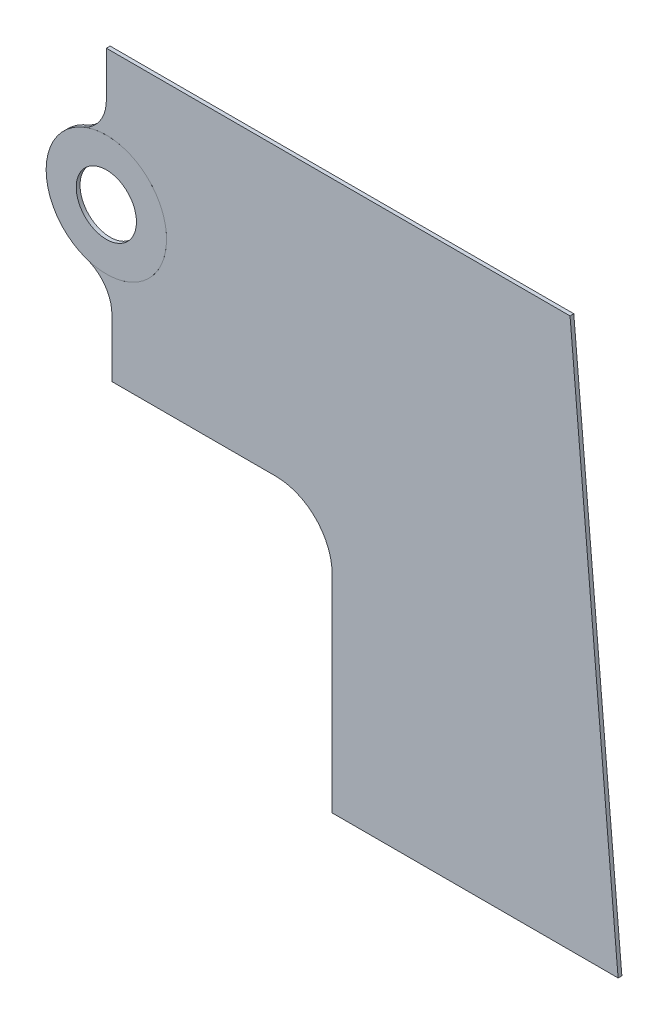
from build123d import *

# Parameters (mm, degrees)
SKETCH1_R              = 8
BOSS_EXTRUDE1_DEPTH    = 1
SPLIT1_SURFACE_1_BACK  = 211.76
SPLIT1_SURFACE_1_DEPTH = 423.52
SPLIT1_SURFACE_2_BACK  = 211.76
SPLIT1_SURFACE_2_DEPTH = 423.52


with BuildPart() as part:
    # Sketch1 → Boss-Extrude1 (new body)
    with BuildSketch(Plane.XY):
        with BuildLine():
            Line((0, 0), (0, 55))
            ThreePointArc((0, 55), (-4.393398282, 65.606601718), (-15, 70))
            Line((-15, 70), (-58.522648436, 70))
            Line((-58.522648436, 70), (-58.522648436, 85.43161905))
            ThreePointArc((-58.522648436, 85.43161905), (-60.374660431, 91.229057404), (-65.24470673, 94.879110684))
            ThreePointArc((-65.24470673, 94.879110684), (-75.992601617, 109.508585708), (-66.153846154, 124.764328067))
            ThreePointArc((-66.153846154, 124.764328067), (-61.679497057, 128.448095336), (-60, 133.995097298))
            Line((-60, 133.995097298), (-60, 145.995097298))
            Line((-60, 145.995097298), (63.227084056, 145.995097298))
            Line((63.227084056, 145.995097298), (76, 0))
            Line((76, 0), (0, 0))
        make_face()
        with Locations((-60, 109.995097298)):
            Circle(SKETCH1_R, mode=Mode.SUBTRACT)
    extrude(amount=BOSS_EXTRUDE1_DEPTH)


with BuildPart() as body_2:
    # Split1: the piece behind the surface
    add(part.part)
    # Split1 surface: a surface, the sketch's curves swept straight by 423.52 mm
    with BuildLine(Plane.XY.offset(1).offset(-SPLIT1_SURFACE_1_BACK), mode=Mode.PRIVATE) as split1_surface_1_path:
        CenterArc((-60, 109.995097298), 16, 0, 360)
    split1_surface_1 = Shell.extrude(split1_surface_1_path.wire(), (0 * SPLIT1_SURFACE_1_DEPTH, 0 * SPLIT1_SURFACE_1_DEPTH, 1 * SPLIT1_SURFACE_1_DEPTH))
    split(bisect_by=split1_surface_1, keep=Keep.BOTTOM)


with BuildPart() as part_1:
    add(part.part)

    # Split1: split by a surface, the side it looks to stays
    # Split1 surface: a surface, the sketch's curves swept straight by 423.52 mm
    with BuildLine(Plane.XY.offset(1).offset(-SPLIT1_SURFACE_2_BACK), mode=Mode.PRIVATE) as split1_surface_2_path:
        CenterArc((-60, 109.995097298), 16, 0, 360)
    split1_surface_2 = Shell.extrude(split1_surface_2_path.wire(), (0 * SPLIT1_SURFACE_2_DEPTH, 0 * SPLIT1_SURFACE_2_DEPTH, 1 * SPLIT1_SURFACE_2_DEPTH))
    split(bisect_by=split1_surface_2, keep=Keep.TOP)


solid = Compound([body_2.part, part_1.part])
